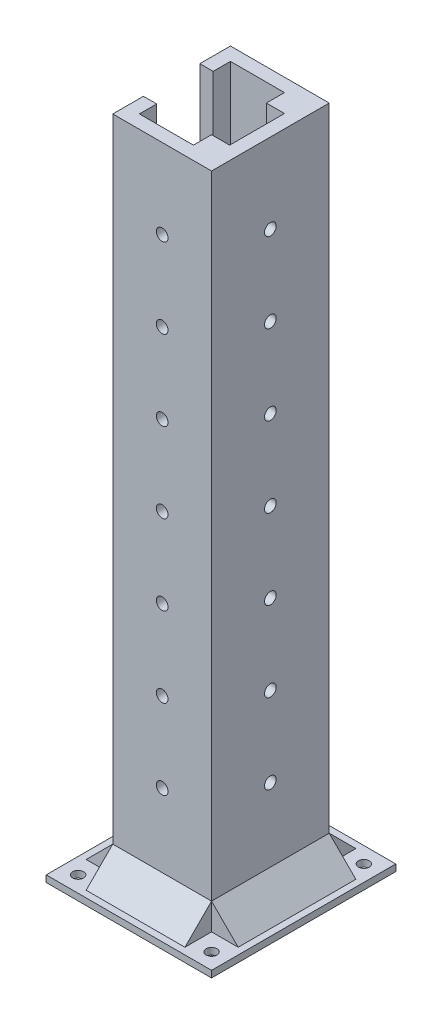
from build123d import *

# Parameters (mm, degrees)
BOSS_EXTRUDE1_DEPTH = 250
SKETCH2_W           = 62.1
SKETCH2_H           = 69.2
SKETCH2_R           = 2.05
BOSS_EXTRUDE2_DEPTH = 2.5
SKETCH3_R           = 2.2
CUT_EXTRUDE1_DEPTH  = 70
SKETCH4_R           = 2.2
CUT_EXTRUDE2_DEPTH  = 70
SKETCH5_W           = 37.1
SKETCH5_H           = 44.2
SKETCH5_W_2         = 27.1
SKETCH5_H_2         = 34.2
BOSS_EXTRUDE3_DEPTH = 10.16
CHAMFER1_SIZE       = 10
BOSS_EXTRUDE4_DEPTH = 18.55


with BuildPart() as part:
    # Sketch1 → Boss-Extrude1 (new body)
    with BuildSketch(Plane(origin=(0, 0, 0), x_dir=(1, 0, 0), z_dir=(0, 1, 0))):
        Polygon((0, 0), (37.1, 0), (37.1, 44.2), (0, 44.2), (0, 32.7), (5, 32.7), (5, 39.2), (25.3, 39.2), (25.3, 32.4), (32.1, 32.4), (32.1, 11.8), (25.3, 11.8), (25.3, 5), (5, 5), (5, 11.5), (0, 11.5), align=None)
    extrude(amount=BOSS_EXTRUDE1_DEPTH)

    # Sketch2 → Boss-Extrude2 (add)
    with BuildSketch(Plane(origin=(0, 0, 0), x_dir=(-1, 0, 0), z_dir=(0, -1, 0))):
        with Locations((-18.55, 22.1)):
            Rectangle(SKETCH2_W, SKETCH2_H)
        with Locations(Location((-43.6, 50.7, 0), (0, 0, 90))):
            Circle(SKETCH2_R, mode=Mode.SUBTRACT)
        with Locations(Location((6.5, 50.7, 0), (0, 0, 270))):
            Circle(SKETCH2_R, mode=Mode.SUBTRACT)
        with Locations(Location((6.5, -6.5, 0), (0, 0, 90))):
            Circle(SKETCH2_R, mode=Mode.SUBTRACT)
        with Locations(Location((-43.6, -6.5, 0), (0, 0, 270))):
            Circle(SKETCH2_R, mode=Mode.SUBTRACT)
    extrude(amount=-BOSS_EXTRUDE2_DEPTH)

    # Sketch3 → Cut-Extrude1 (cut)
    with BuildSketch(Plane(origin=(0, 0, -44.2), x_dir=(-1, 0, 0), z_dir=(0, 0, -1))):
        with Locations((-18.55, 220)):
            Circle(SKETCH3_R)
        with Locations((-18.55, 190)):
            Circle(SKETCH3_R)
        with Locations((-18.55, 160)):
            Circle(SKETCH3_R)
        with Locations((-18.55, 130)):
            Circle(SKETCH3_R)
        with Locations((-18.55, 100)):
            Circle(SKETCH3_R)
        with Locations((-18.55, 70)):
            Circle(SKETCH3_R)
        with Locations((-18.55, 40)):
            Circle(SKETCH3_R)
    extrude(amount=-CUT_EXTRUDE1_DEPTH, mode=Mode.SUBTRACT)

    # Sketch4 → Cut-Extrude2 (cut)
    with BuildSketch(Plane(origin=(37.1, 0, 0), x_dir=(0, 0, -1), z_dir=(1, 0, 0))):
        with Locations((22.1, 220)):
            Circle(SKETCH4_R)
        with Locations((22.1, 190)):
            Circle(SKETCH4_R)
        with Locations((22.1, 160)):
            Circle(SKETCH4_R)
        with Locations((22.1, 130)):
            Circle(SKETCH4_R)
        with Locations((22.1, 100)):
            Circle(SKETCH4_R)
        with Locations((22.1, 70)):
            Circle(SKETCH4_R)
        with Locations((22.1, 40)):
            Circle(SKETCH4_R)
    extrude(amount=-CUT_EXTRUDE2_DEPTH, mode=Mode.SUBTRACT)

    # Sketch5 → Boss-Extrude3 (add)
    with BuildSketch(Plane.XZ):
        with Locations((18.55, -22.1)):
            Rectangle(SKETCH5_W, SKETCH5_H)
        with Locations((18.55, -22.1)):
            Rectangle(SKETCH5_W_2, SKETCH5_H_2, mode=Mode.SUBTRACT)
    extrude(amount=BOSS_EXTRUDE3_DEPTH)

    # Chamfer1
    chamfer1_edges = [part.edges().sort_by_distance(p)[0] for p in [
        (0, 2.5, -38.45),
        (37.1, 2.5, -22.1),
        (0, 2.5, -5.75),
    ]]
    chamfer(chamfer1_edges, length=CHAMFER1_SIZE)

    # Sketch6 → Boss-Extrude4 (add, symmetric)
    with BuildSketch(Plane.ZY.offset(-18.55)):
        Polygon((-44.2, 2.5), (-54.2, 2.5), (-44.2, 12.5), align=None)
        Polygon((0, 2.5), (10, 2.5), (0, 12.5), align=None)
    extrude(amount=BOSS_EXTRUDE4_DEPTH, both=True)


solid = part.part
